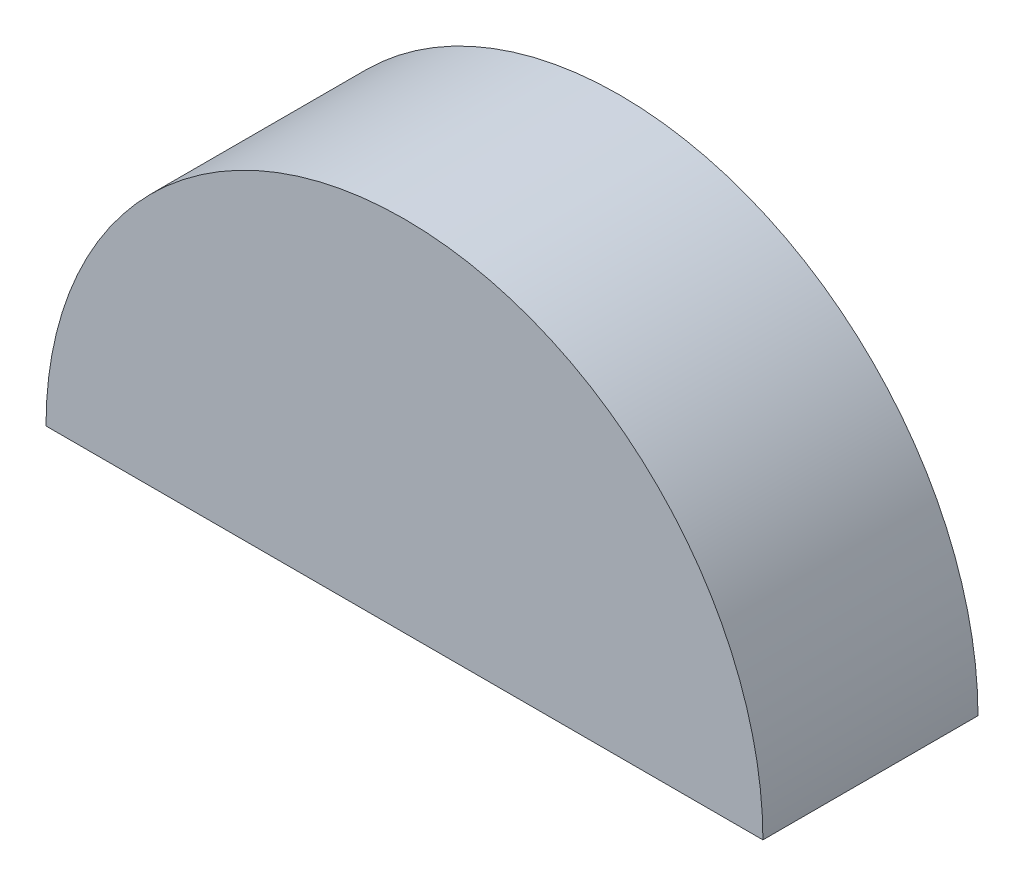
ISO-10303-21;
HEADER;
FILE_DESCRIPTION(('STEP AP214'),'2;1');
FILE_NAME('part.step','',(''),(''),'','','');
FILE_SCHEMA(('AUTOMOTIVE_DESIGN { 1 0 10303 214 1 1 1 1 }'));
ENDSEC;
DATA;
#1=APPLICATION_CONTEXT('core data for automotive mechanical design processes');
#2=APPLICATION_PROTOCOL_DEFINITION('international standard','automotive_design',2000,#1);
#3=PRODUCT_CONTEXT('',#1,'mechanical');
#4=PRODUCT('Part','Part','',(#3));
#5=PRODUCT_RELATED_PRODUCT_CATEGORY('part','',(#4));
#6=PRODUCT_DEFINITION_FORMATION('','',#4);
#7=PRODUCT_DEFINITION_CONTEXT('part definition',#1,'design');
#8=PRODUCT_DEFINITION('design','',#6,#7);
#9=PRODUCT_DEFINITION_SHAPE('','',#8);
#10=(LENGTH_UNIT() NAMED_UNIT(*) SI_UNIT(.MILLI.,.METRE.));
#11=(NAMED_UNIT(*) PLANE_ANGLE_UNIT() SI_UNIT($,.RADIAN.));
#12=(NAMED_UNIT(*) SI_UNIT($,.STERADIAN.) SOLID_ANGLE_UNIT());
#13=UNCERTAINTY_MEASURE_WITH_UNIT(LENGTH_MEASURE(1.E-05),#10,'distance_accuracy_value','');
#14=(GEOMETRIC_REPRESENTATION_CONTEXT(3) GLOBAL_UNCERTAINTY_ASSIGNED_CONTEXT((#13)) GLOBAL_UNIT_ASSIGNED_CONTEXT((#10,
#11,#12)) REPRESENTATION_CONTEXT('',''));
#15=CARTESIAN_POINT('',(0.,0.,0.));
#16=DIRECTION('',(0.,0.,1.));
#17=DIRECTION('',(1.,0.,0.));
#18=AXIS2_PLACEMENT_3D('',#15,#16,#17);
#19=CARTESIAN_POINT('',(5.,0.,3.));
#20=DIRECTION('',(0.,0.,-1.));
#21=DIRECTION('',(-1.,0.,0.));
#22=AXIS2_PLACEMENT_3D('',#19,#20,#21);
#23=CYLINDRICAL_SURFACE('',#22,5.);
#24=CARTESIAN_POINT('',(5.,0.,0.));
#25=DIRECTION('',(0.,0.,1.));
#26=DIRECTION('',(1.,0.,0.));
#27=AXIS2_PLACEMENT_3D('',#24,#25,#26);
#28=CIRCLE('',#27,5.);
#29=CARTESIAN_POINT('',(10.,0.,0.));
#30=VERTEX_POINT('',#29);
#31=CARTESIAN_POINT('',(0.,0.,0.));
#32=VERTEX_POINT('',#31);
#33=EDGE_CURVE('E64',#30,#32,#28,.T.);
#34=ORIENTED_EDGE('',*,*,#33,.T.);
#35=DIRECTION('',(0.,0.,-1.));
#36=VECTOR('',#35,1.);
#37=CARTESIAN_POINT('',(0.,0.,3.));
#38=LINE('',#37,#36);
#39=CARTESIAN_POINT('',(0.,0.,3.));
#40=VERTEX_POINT('',#39);
#41=EDGE_CURVE('E11',#40,#32,#38,.T.);
#42=ORIENTED_EDGE('',*,*,#41,.F.);
#43=CARTESIAN_POINT('',(5.,0.,3.));
#44=DIRECTION('',(0.,0.,1.));
#45=DIRECTION('',(1.,0.,0.));
#46=AXIS2_PLACEMENT_3D('',#43,#44,#45);
#47=CIRCLE('',#46,5.);
#48=CARTESIAN_POINT('',(10.,0.,3.));
#49=VERTEX_POINT('',#48);
#50=EDGE_CURVE('E63',#49,#40,#47,.T.);
#51=ORIENTED_EDGE('',*,*,#50,.F.);
#52=DIRECTION('',(0.,0.,-1.));
#53=VECTOR('',#52,1.);
#54=CARTESIAN_POINT('',(10.,0.,3.));
#55=LINE('',#54,#53);
#56=EDGE_CURVE('E41',#49,#30,#55,.T.);
#57=ORIENTED_EDGE('',*,*,#56,.T.);
#58=EDGE_LOOP('',(#34,#42,#51,#57));
#59=FACE_BOUND('',#58,.T.);
#60=ADVANCED_FACE('F33',(#59),#23,.T.);
#61=CARTESIAN_POINT('',(0.,0.,3.));
#62=DIRECTION('',(0.,1.,0.));
#63=DIRECTION('',(0.,0.,1.));
#64=AXIS2_PLACEMENT_3D('',#61,#62,#63);
#65=PLANE('',#64);
#66=DIRECTION('',(1.,0.,0.));
#67=VECTOR('',#66,1.);
#68=CARTESIAN_POINT('',(0.,0.,0.));
#69=LINE('',#68,#67);
#70=EDGE_CURVE('E56',#32,#30,#69,.T.);
#71=ORIENTED_EDGE('',*,*,#70,.T.);
#72=ORIENTED_EDGE('',*,*,#56,.F.);
#73=DIRECTION('',(1.,0.,0.));
#74=VECTOR('',#73,1.);
#75=CARTESIAN_POINT('',(0.,0.,3.));
#76=LINE('',#75,#74);
#77=EDGE_CURVE('E48',#40,#49,#76,.T.);
#78=ORIENTED_EDGE('',*,*,#77,.F.);
#79=ORIENTED_EDGE('',*,*,#41,.T.);
#80=EDGE_LOOP('',(#71,#72,#78,#79));
#81=FACE_BOUND('',#80,.T.);
#82=ADVANCED_FACE('F59',(#81),#65,.F.);
#83=CARTESIAN_POINT('',(5.,0.,3.));
#84=DIRECTION('',(0.,0.,1.));
#85=DIRECTION('',(1.,0.,0.));
#86=AXIS2_PLACEMENT_3D('',#83,#84,#85);
#87=PLANE('',#86);
#88=ORIENTED_EDGE('',*,*,#50,.T.);
#89=ORIENTED_EDGE('',*,*,#77,.T.);
#90=EDGE_LOOP('',(#88,#89));
#91=FACE_BOUND('',#90,.T.);
#92=ADVANCED_FACE('F71',(#91),#87,.T.);
#93=CARTESIAN_POINT('',(5.,0.,0.));
#94=DIRECTION('',(0.,0.,1.));
#95=DIRECTION('',(1.,0.,0.));
#96=AXIS2_PLACEMENT_3D('',#93,#94,#95);
#97=PLANE('',#96);
#98=ORIENTED_EDGE('',*,*,#33,.F.);
#99=ORIENTED_EDGE('',*,*,#70,.F.);
#100=EDGE_LOOP('',(#98,#99));
#101=FACE_BOUND('',#100,.T.);
#102=ADVANCED_FACE('F67',(#101),#97,.F.);
#103=CLOSED_SHELL('',(#60,#82,#92,#102));
#104=MANIFOLD_SOLID_BREP('B2',#103);
#105=ADVANCED_BREP_SHAPE_REPRESENTATION('',(#18,#104),#14);
#106=SHAPE_DEFINITION_REPRESENTATION(#9,#105);
ENDSEC;
END-ISO-10303-21;
